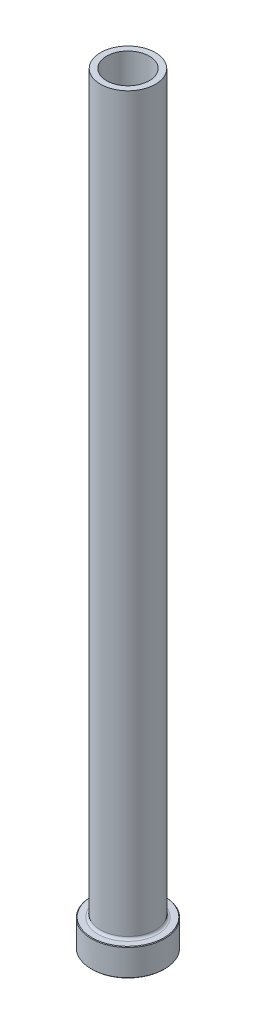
ISO-10303-21;
HEADER;
FILE_DESCRIPTION(('STEP AP214'),'2;1');
FILE_NAME('part.step','',(''),(''),'','','');
FILE_SCHEMA(('AUTOMOTIVE_DESIGN { 1 0 10303 214 1 1 1 1 }'));
ENDSEC;
DATA;
#1=APPLICATION_CONTEXT('core data for automotive mechanical design processes');
#2=APPLICATION_PROTOCOL_DEFINITION('international standard','automotive_design',2000,#1);
#3=PRODUCT_CONTEXT('',#1,'mechanical');
#4=PRODUCT('Part','Part','',(#3));
#5=PRODUCT_RELATED_PRODUCT_CATEGORY('part','',(#4));
#6=PRODUCT_DEFINITION_FORMATION('','',#4);
#7=PRODUCT_DEFINITION_CONTEXT('part definition',#1,'design');
#8=PRODUCT_DEFINITION('design','',#6,#7);
#9=PRODUCT_DEFINITION_SHAPE('','',#8);
#10=(LENGTH_UNIT() NAMED_UNIT(*) SI_UNIT(.MILLI.,.METRE.));
#11=(NAMED_UNIT(*) PLANE_ANGLE_UNIT() SI_UNIT($,.RADIAN.));
#12=(NAMED_UNIT(*) SI_UNIT($,.STERADIAN.) SOLID_ANGLE_UNIT());
#13=UNCERTAINTY_MEASURE_WITH_UNIT(LENGTH_MEASURE(1.E-05),#10,'distance_accuracy_value','');
#14=(GEOMETRIC_REPRESENTATION_CONTEXT(3) GLOBAL_UNCERTAINTY_ASSIGNED_CONTEXT((#13)) GLOBAL_UNIT_ASSIGNED_CONTEXT((#10,
#11,#12)) REPRESENTATION_CONTEXT('',''));
#15=CARTESIAN_POINT('',(0.,0.,0.));
#16=DIRECTION('',(0.,0.,1.));
#17=DIRECTION('',(1.,0.,0.));
#18=AXIS2_PLACEMENT_3D('',#15,#16,#17);
#19=CARTESIAN_POINT('',(0.,92.1876809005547,0.));
#20=DIRECTION('',(0.,1.,0.));
#21=DIRECTION('',(0.,0.,1.));
#22=AXIS2_PLACEMENT_3D('',#19,#20,#21);
#23=CYLINDRICAL_SURFACE('',#22,7.00000000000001);
#24=CARTESIAN_POINT('',(0.,250.,0.));
#25=DIRECTION('',(0.,1.,0.));
#26=DIRECTION('',(0.,0.,1.));
#27=AXIS2_PLACEMENT_3D('',#24,#25,#26);
#28=CIRCLE('',#27,7.00000000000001);
#29=CARTESIAN_POINT('',(0.,250.,7.00000000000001));
#30=VERTEX_POINT('',#29);
#31=EDGE_CURVE('E62',#30,#30,#28,.T.);
#32=ORIENTED_EDGE('',*,*,#31,.T.);
#33=EDGE_LOOP('',(#32));
#34=FACE_BOUND('',#33,.T.);
#35=CARTESIAN_POINT('',(0.,195.,0.));
#36=DIRECTION('',(0.,1.,0.));
#37=DIRECTION('',(0.,0.,1.));
#38=AXIS2_PLACEMENT_3D('',#35,#36,#37);
#39=CIRCLE('',#38,7.00000000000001);
#40=CARTESIAN_POINT('',(0.,195.,7.00000000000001));
#41=VERTEX_POINT('',#40);
#42=EDGE_CURVE('E71',#41,#41,#39,.T.);
#43=ORIENTED_EDGE('',*,*,#42,.F.);
#44=EDGE_LOOP('',(#43));
#45=FACE_BOUND('',#44,.T.);
#46=ADVANCED_FACE('F30',(#34,#45),#23,.F.);
#47=CARTESIAN_POINT('',(-7.00000000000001,250.,0.));
#48=DIRECTION('',(0.,1.,0.));
#49=DIRECTION('',(0.,0.,1.));
#50=AXIS2_PLACEMENT_3D('',#47,#48,#49);
#51=PLANE('',#50);
#52=CARTESIAN_POINT('',(0.,250.,0.));
#53=DIRECTION('',(0.,1.,0.));
#54=DIRECTION('',(0.,0.,1.));
#55=AXIS2_PLACEMENT_3D('',#52,#53,#54);
#56=CIRCLE('',#55,9.00000000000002);
#57=CARTESIAN_POINT('',(0.,250.,9.00000000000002));
#58=VERTEX_POINT('',#57);
#59=EDGE_CURVE('E65',#58,#58,#56,.T.);
#60=ORIENTED_EDGE('',*,*,#59,.T.);
#61=EDGE_LOOP('',(#60));
#62=FACE_BOUND('',#61,.T.);
#63=ORIENTED_EDGE('',*,*,#31,.F.);
#64=EDGE_LOOP('',(#63));
#65=FACE_BOUND('',#64,.T.);
#66=ADVANCED_FACE('F79',(#62,#65),#51,.T.);
#67=CARTESIAN_POINT('',(0.,92.1876809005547,0.));
#68=DIRECTION('',(0.,1.,0.));
#69=DIRECTION('',(0.,0.,1.));
#70=AXIS2_PLACEMENT_3D('',#67,#68,#69);
#71=CYLINDRICAL_SURFACE('',#70,9.);
#72=CARTESIAN_POINT('',(0.,9.8,0.));
#73=DIRECTION('',(0.,1.,0.));
#74=DIRECTION('',(0.,0.,1.));
#75=AXIS2_PLACEMENT_3D('',#72,#73,#74);
#76=CIRCLE('',#75,9.);
#77=CARTESIAN_POINT('',(0.,9.8,9.));
#78=VERTEX_POINT('',#77);
#79=EDGE_CURVE('E59',#78,#78,#76,.T.);
#80=ORIENTED_EDGE('',*,*,#79,.T.);
#81=EDGE_LOOP('',(#80));
#82=FACE_BOUND('',#81,.T.);
#83=ORIENTED_EDGE('',*,*,#59,.F.);
#84=EDGE_LOOP('',(#83));
#85=FACE_BOUND('',#84,.T.);
#86=ADVANCED_FACE('F85',(#82,#85),#71,.T.);
#87=CARTESIAN_POINT('',(-8.99999999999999,9.,0.));
#88=DIRECTION('',(0.,1.,0.));
#89=DIRECTION('',(0.,0.,1.));
#90=AXIS2_PLACEMENT_3D('',#87,#88,#89);
#91=PLANE('',#90);
#92=CARTESIAN_POINT('',(0.,9.,0.));
#93=DIRECTION('',(0.,1.,0.));
#94=DIRECTION('',(0.,0.,1.));
#95=AXIS2_PLACEMENT_3D('',#92,#93,#94);
#96=CIRCLE('',#95,11.8000000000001);
#97=CARTESIAN_POINT('',(0.,9.,11.8000000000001));
#98=VERTEX_POINT('',#97);
#99=EDGE_CURVE('E53',#98,#98,#96,.T.);
#100=ORIENTED_EDGE('',*,*,#99,.T.);
#101=EDGE_LOOP('',(#100));
#102=FACE_BOUND('',#101,.T.);
#103=CARTESIAN_POINT('',(0.,9.,0.));
#104=DIRECTION('',(0.,1.,0.));
#105=DIRECTION('',(0.,0.,1.));
#106=AXIS2_PLACEMENT_3D('',#103,#104,#105);
#107=CIRCLE('',#106,9.8);
#108=CARTESIAN_POINT('',(0.,9.,9.8));
#109=VERTEX_POINT('',#108);
#110=EDGE_CURVE('E56',#109,#109,#107,.F.);
#111=ORIENTED_EDGE('',*,*,#110,.T.);
#112=EDGE_LOOP('',(#111));
#113=FACE_BOUND('',#112,.T.);
#114=ADVANCED_FACE('F111',(#102,#113),#91,.T.);
#115=CARTESIAN_POINT('',(0.,92.1876809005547,0.));
#116=DIRECTION('',(0.,1.,0.));
#117=DIRECTION('',(0.,0.,1.));
#118=AXIS2_PLACEMENT_3D('',#115,#116,#117);
#119=CYLINDRICAL_SURFACE('',#118,12.);
#120=CARTESIAN_POINT('',(0.,8.80000000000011,0.));
#121=DIRECTION('',(0.,1.,0.));
#122=DIRECTION('',(0.,0.,1.));
#123=AXIS2_PLACEMENT_3D('',#120,#121,#122);
#124=CIRCLE('',#123,12.);
#125=CARTESIAN_POINT('',(0.,8.80000000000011,12.));
#126=VERTEX_POINT('',#125);
#127=EDGE_CURVE('E45',#126,#126,#124,.F.);
#128=ORIENTED_EDGE('',*,*,#127,.T.);
#129=EDGE_LOOP('',(#128));
#130=FACE_BOUND('',#129,.T.);
#131=CARTESIAN_POINT('',(0.,0.200000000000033,0.));
#132=DIRECTION('',(0.,-1.,0.));
#133=DIRECTION('',(0.,0.,-1.));
#134=AXIS2_PLACEMENT_3D('',#131,#132,#133);
#135=CIRCLE('',#134,12.);
#136=CARTESIAN_POINT('',(0.,0.200000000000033,-12.));
#137=VERTEX_POINT('',#136);
#138=EDGE_CURVE('E50',#137,#137,#135,.F.);
#139=ORIENTED_EDGE('',*,*,#138,.T.);
#140=EDGE_LOOP('',(#139));
#141=FACE_BOUND('',#140,.T.);
#142=ADVANCED_FACE('F108',(#130,#141),#119,.T.);
#143=CARTESIAN_POINT('',(-12.,0.,0.));
#144=DIRECTION('',(0.,-1.,0.));
#145=DIRECTION('',(0.,0.,-1.));
#146=AXIS2_PLACEMENT_3D('',#143,#144,#145);
#147=PLANE('',#146);
#148=CARTESIAN_POINT('',(0.,0.,0.));
#149=DIRECTION('',(0.,-1.,0.));
#150=DIRECTION('',(0.,0.,-1.));
#151=AXIS2_PLACEMENT_3D('',#148,#149,#150);
#152=CIRCLE('',#151,7.75000000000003);
#153=CARTESIAN_POINT('',(0.,0.,-7.75000000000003));
#154=VERTEX_POINT('',#153);
#155=EDGE_CURVE('E37',#154,#154,#152,.F.);
#156=ORIENTED_EDGE('',*,*,#155,.T.);
#157=EDGE_LOOP('',(#156));
#158=FACE_BOUND('',#157,.T.);
#159=CARTESIAN_POINT('',(0.,0.,0.));
#160=DIRECTION('',(0.,-1.,0.));
#161=DIRECTION('',(0.,0.,-1.));
#162=AXIS2_PLACEMENT_3D('',#159,#160,#161);
#163=CIRCLE('',#162,11.8);
#164=CARTESIAN_POINT('',(0.,0.,-11.8));
#165=VERTEX_POINT('',#164);
#166=EDGE_CURVE('E41',#165,#165,#163,.T.);
#167=ORIENTED_EDGE('',*,*,#166,.T.);
#168=EDGE_LOOP('',(#167));
#169=FACE_BOUND('',#168,.T.);
#170=ADVANCED_FACE('F110',(#158,#169),#147,.T.);
#171=CARTESIAN_POINT('',(0.,92.1876809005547,0.));
#172=DIRECTION('',(0.,1.,0.));
#173=DIRECTION('',(0.,0.,1.));
#174=AXIS2_PLACEMENT_3D('',#171,#172,#173);
#175=CYLINDRICAL_SURFACE('',#174,7.25);
#176=CARTESIAN_POINT('',(0.,0.500000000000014,0.));
#177=DIRECTION('',(0.,-1.,0.));
#178=DIRECTION('',(0.,0.,-1.));
#179=AXIS2_PLACEMENT_3D('',#176,#177,#178);
#180=CIRCLE('',#179,7.25);
#181=CARTESIAN_POINT('',(0.,0.500000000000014,-7.25));
#182=VERTEX_POINT('',#181);
#183=EDGE_CURVE('E10',#182,#182,#180,.T.);
#184=ORIENTED_EDGE('',*,*,#183,.T.);
#185=EDGE_LOOP('',(#184));
#186=FACE_BOUND('',#185,.T.);
#187=CARTESIAN_POINT('',(0.,183.,0.));
#188=DIRECTION('',(0.,1.,0.));
#189=DIRECTION('',(0.,0.,1.));
#190=AXIS2_PLACEMENT_3D('',#187,#188,#189);
#191=CIRCLE('',#190,7.25000000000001);
#192=CARTESIAN_POINT('',(0.,183.,7.25000000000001));
#193=VERTEX_POINT('',#192);
#194=EDGE_CURVE('E68',#193,#193,#191,.T.);
#195=ORIENTED_EDGE('',*,*,#194,.T.);
#196=EDGE_LOOP('',(#195));
#197=FACE_BOUND('',#196,.T.);
#198=ADVANCED_FACE('F118',(#186,#197),#175,.F.);
#199=CARTESIAN_POINT('',(0.,183.,0.));
#200=DIRECTION('',(0.,-1.,0.));
#201=DIRECTION('',(0.,0.,-1.));
#202=AXIS2_PLACEMENT_3D('',#199,#200,#201);
#203=CONICAL_SURFACE('',#202,7.25000000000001,0.0208303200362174);
#204=ORIENTED_EDGE('',*,*,#42,.T.);
#205=EDGE_LOOP('',(#204));
#206=FACE_BOUND('',#205,.T.);
#207=ORIENTED_EDGE('',*,*,#194,.F.);
#208=EDGE_LOOP('',(#207));
#209=FACE_BOUND('',#208,.T.);
#210=ADVANCED_FACE('F75',(#206,#209),#203,.F.);
#211=CARTESIAN_POINT('',(0.,9.8,0.));
#212=DIRECTION('',(0.,1.,0.));
#213=DIRECTION('',(0.,0.,1.));
#214=AXIS2_PLACEMENT_3D('',#211,#212,#213);
#215=TOROIDAL_SURFACE('',#214,9.8,0.8);
#216=ORIENTED_EDGE('',*,*,#110,.F.);
#217=EDGE_LOOP('',(#216));
#218=FACE_BOUND('',#217,.T.);
#219=ORIENTED_EDGE('',*,*,#79,.F.);
#220=EDGE_LOOP('',(#219));
#221=FACE_BOUND('',#220,.T.);
#222=ADVANCED_FACE('F90',(#218,#221),#215,.F.);
#223=CARTESIAN_POINT('',(0.,9.00000000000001,0.));
#224=DIRECTION('',(0.,-1.,0.));
#225=DIRECTION('',(0.,0.,-1.));
#226=AXIS2_PLACEMENT_3D('',#223,#224,#225);
#227=CONICAL_SURFACE('',#226,11.8000000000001,0.785398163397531);
#228=ORIENTED_EDGE('',*,*,#127,.F.);
#229=EDGE_LOOP('',(#228));
#230=FACE_BOUND('',#229,.T.);
#231=ORIENTED_EDGE('',*,*,#99,.F.);
#232=EDGE_LOOP('',(#231));
#233=FACE_BOUND('',#232,.T.);
#234=ADVANCED_FACE('F93',(#230,#233),#227,.T.);
#235=CARTESIAN_POINT('',(0.,0.200000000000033,0.));
#236=DIRECTION('',(0.,1.,0.));
#237=DIRECTION('',(0.,0.,1.));
#238=AXIS2_PLACEMENT_3D('',#235,#236,#237);
#239=CONICAL_SURFACE('',#238,12.,0.785398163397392);
#240=ORIENTED_EDGE('',*,*,#166,.F.);
#241=EDGE_LOOP('',(#240));
#242=FACE_BOUND('',#241,.T.);
#243=ORIENTED_EDGE('',*,*,#138,.F.);
#244=EDGE_LOOP('',(#243));
#245=FACE_BOUND('',#244,.T.);
#246=ADVANCED_FACE('F96',(#242,#245),#239,.T.);
#247=CARTESIAN_POINT('',(0.,0.,0.));
#248=DIRECTION('',(0.,-1.,0.));
#249=DIRECTION('',(0.,0.,-1.));
#250=AXIS2_PLACEMENT_3D('',#247,#248,#249);
#251=CONICAL_SURFACE('',#250,7.75000000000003,0.785398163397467);
#252=ORIENTED_EDGE('',*,*,#183,.F.);
#253=EDGE_LOOP('',(#252));
#254=FACE_BOUND('',#253,.T.);
#255=ORIENTED_EDGE('',*,*,#155,.F.);
#256=EDGE_LOOP('',(#255));
#257=FACE_BOUND('',#256,.T.);
#258=ADVANCED_FACE('F32',(#254,#257),#251,.F.);
#259=CLOSED_SHELL('',(#46,#66,#86,#114,#142,#170,#198,#210,#222,#234,#246,#258));
#260=MANIFOLD_SOLID_BREP('B2',#259);
#261=ADVANCED_BREP_SHAPE_REPRESENTATION('',(#18,#260),#14);
#262=SHAPE_DEFINITION_REPRESENTATION(#9,#261);
ENDSEC;
END-ISO-10303-21;
